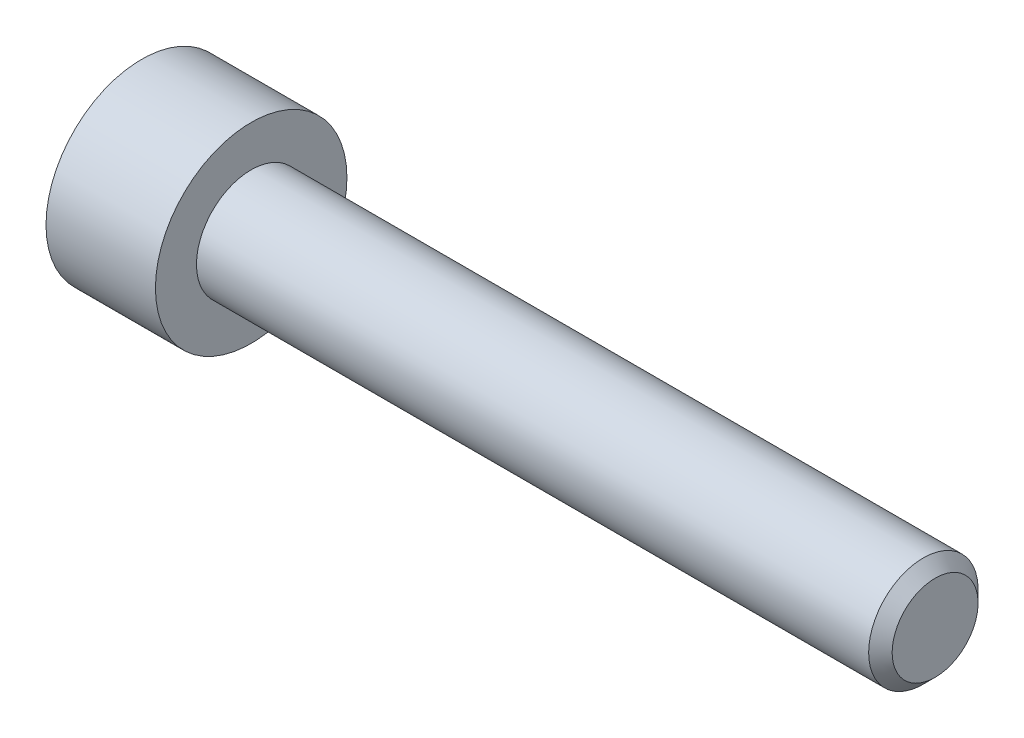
from build123d import *

# Parameters (mm, degrees)
ENL_V_MAT_EXTRU_1_DEPTH = 2


with BuildPart() as part:
    # Esquisse1 → R_volution1 (revolve)
    with BuildSketch(Plane.XY, mode=Mode.PRIVATE) as r_volution1_sk:
        Polygon((-4, 0), (-4, 3.5), (0, 3.5), (0, 2), (24.5705, 2), (25, 1.5705), (25, 0), align=None)
    revolve(r_volution1_sk.sketch.rotate(Axis((25, 0, 0), (-1, 0, 0)), 270), axis=Axis((25, 0, 0), (-1, 0, 0)))

    # Esquisse2 → Enl_v. mat.-Extru.1 (cut)
    with BuildSketch(Plane(origin=(-4, 0, 0), x_dir=(0, 0, -1), z_dir=(1, 0, 0))):
        Polygon((-1.5, 0.866025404), (-1.5, -0.866025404), (0, -1.732050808), (1.5, -0.866025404), (1.5, 0.866025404), (0, 1.732050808), align=None)
    extrude(amount=ENL_V_MAT_EXTRU_1_DEPTH, mode=Mode.SUBTRACT)

    # Esquisse3 → Enl_vement de mati_re-R_volution1 (revolve, cut)
    with BuildSketch(Plane.XY, mode=Mode.PRIVATE) as enl_vement_de_mati_re_r_volution1_sk:
        Polygon((-2, 0), (-2, 1.49), (-1.139748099, 0), align=None)
    revolve(enl_vement_de_mati_re_r_volution1_sk.sketch.rotate(Axis((-1.139748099, 0, 0), (-1, 0, 0)), 270), axis=Axis((-1.139748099, 0, 0), (-1, 0, 0)), mode=Mode.SUBTRACT)


solid = part.part
